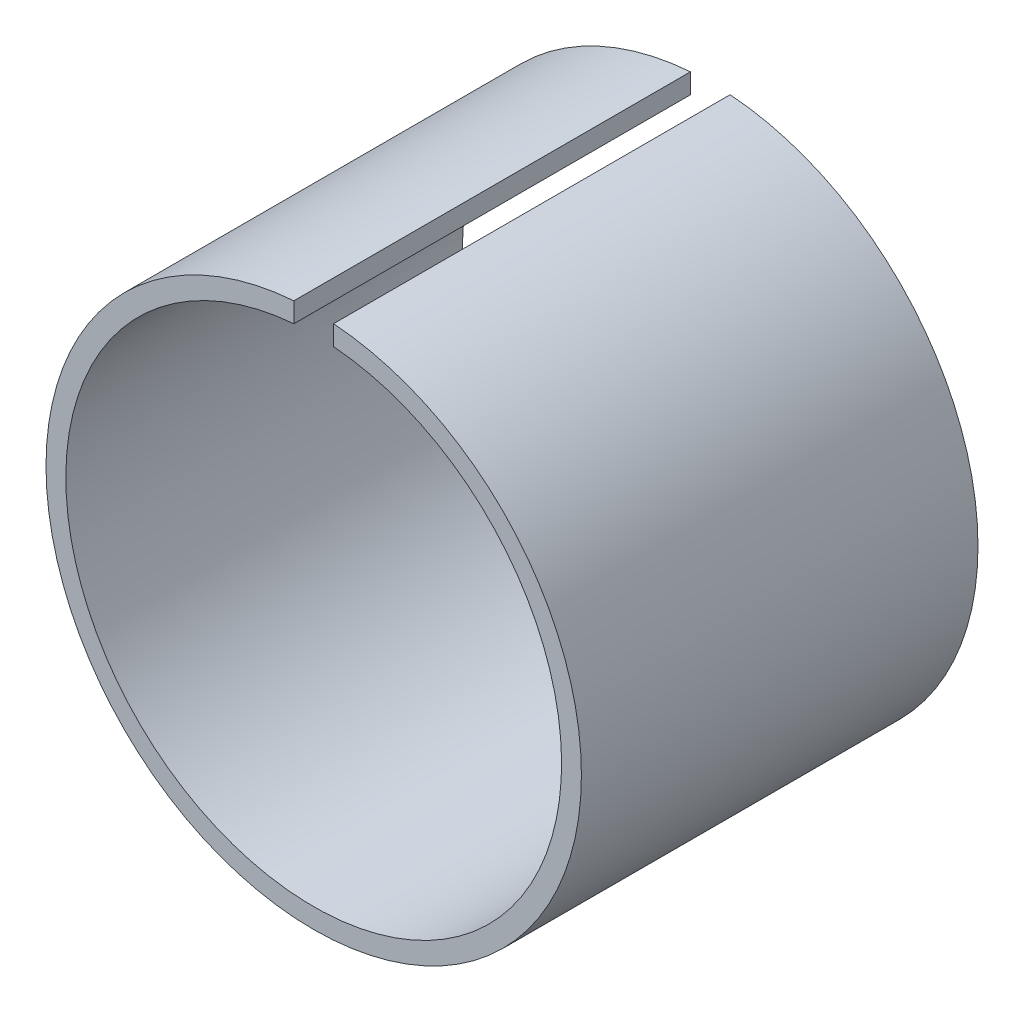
ISO-10303-21;
HEADER;
FILE_DESCRIPTION(('STEP AP214'),'2;1');
FILE_NAME('part.step','',(''),(''),'','','');
FILE_SCHEMA(('AUTOMOTIVE_DESIGN { 1 0 10303 214 1 1 1 1 }'));
ENDSEC;
DATA;
#1=APPLICATION_CONTEXT('core data for automotive mechanical design processes');
#2=APPLICATION_PROTOCOL_DEFINITION('international standard','automotive_design',2000,#1);
#3=PRODUCT_CONTEXT('',#1,'mechanical');
#4=PRODUCT('Part','Part','',(#3));
#5=PRODUCT_RELATED_PRODUCT_CATEGORY('part','',(#4));
#6=PRODUCT_DEFINITION_FORMATION('','',#4);
#7=PRODUCT_DEFINITION_CONTEXT('part definition',#1,'design');
#8=PRODUCT_DEFINITION('design','',#6,#7);
#9=PRODUCT_DEFINITION_SHAPE('','',#8);
#10=(LENGTH_UNIT() NAMED_UNIT(*) SI_UNIT(.MILLI.,.METRE.));
#11=(NAMED_UNIT(*) PLANE_ANGLE_UNIT() SI_UNIT($,.RADIAN.));
#12=(NAMED_UNIT(*) SI_UNIT($,.STERADIAN.) SOLID_ANGLE_UNIT());
#13=UNCERTAINTY_MEASURE_WITH_UNIT(LENGTH_MEASURE(1.E-05),#10,'distance_accuracy_value','');
#14=(GEOMETRIC_REPRESENTATION_CONTEXT(3) GLOBAL_UNCERTAINTY_ASSIGNED_CONTEXT((#13)) GLOBAL_UNIT_ASSIGNED_CONTEXT((#10,
#11,#12)) REPRESENTATION_CONTEXT('',''));
#15=CARTESIAN_POINT('',(0.,0.,0.));
#16=DIRECTION('',(0.,0.,1.));
#17=DIRECTION('',(1.,0.,0.));
#18=AXIS2_PLACEMENT_3D('',#15,#16,#17);
#19=CARTESIAN_POINT('',(0.,0.,20.));
#20=DIRECTION('',(0.,0.,-1.));
#21=DIRECTION('',(-1.,0.,0.));
#22=AXIS2_PLACEMENT_3D('',#19,#20,#21);
#23=CYLINDRICAL_SURFACE('',#22,13.5);
#24=CARTESIAN_POINT('',(0.,0.,0.));
#25=DIRECTION('',(0.,0.,1.));
#26=DIRECTION('',(1.,0.,0.));
#27=AXIS2_PLACEMENT_3D('',#24,#25,#26);
#28=CIRCLE('',#27,13.5);
#29=CARTESIAN_POINT('',(-1.,13.4629120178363,0.));
#30=VERTEX_POINT('',#29);
#31=CARTESIAN_POINT('',(1.,13.4629120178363,0.));
#32=VERTEX_POINT('',#31);
#33=EDGE_CURVE('E78',#30,#32,#28,.T.);
#34=ORIENTED_EDGE('',*,*,#33,.T.);
#35=DIRECTION('',(0.,0.,-1.));
#36=VECTOR('',#35,1.);
#37=CARTESIAN_POINT('',(1.,13.4629120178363,20.));
#38=LINE('',#37,#36);
#39=CARTESIAN_POINT('',(1.,13.4629120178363,20.));
#40=VERTEX_POINT('',#39);
#41=EDGE_CURVE('E11',#40,#32,#38,.T.);
#42=ORIENTED_EDGE('',*,*,#41,.F.);
#43=CARTESIAN_POINT('',(0.,0.,20.));
#44=DIRECTION('',(0.,0.,1.));
#45=DIRECTION('',(1.,0.,0.));
#46=AXIS2_PLACEMENT_3D('',#43,#44,#45);
#47=CIRCLE('',#46,13.5);
#48=CARTESIAN_POINT('',(-1.,13.4629120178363,20.));
#49=VERTEX_POINT('',#48);
#50=EDGE_CURVE('E96',#49,#40,#47,.T.);
#51=ORIENTED_EDGE('',*,*,#50,.F.);
#52=DIRECTION('',(0.,0.,-1.));
#53=VECTOR('',#52,1.);
#54=CARTESIAN_POINT('',(-1.,13.4629120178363,20.));
#55=LINE('',#54,#53);
#56=EDGE_CURVE('E90',#49,#30,#55,.T.);
#57=ORIENTED_EDGE('',*,*,#56,.T.);
#58=EDGE_LOOP('',(#34,#42,#51,#57));
#59=FACE_BOUND('',#58,.T.);
#60=ADVANCED_FACE('F34',(#59),#23,.T.);
#61=CARTESIAN_POINT('',(1.,13.4629120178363,20.));
#62=DIRECTION('',(1.,0.,0.));
#63=DIRECTION('',(0.,1.,0.));
#64=AXIS2_PLACEMENT_3D('',#61,#62,#63);
#65=PLANE('',#64);
#66=DIRECTION('',(0.,-1.,0.));
#67=VECTOR('',#66,1.);
#68=CARTESIAN_POINT('',(1.,13.4629120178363,0.));
#69=LINE('',#68,#67);
#70=CARTESIAN_POINT('',(1.,12.4599357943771,0.));
#71=VERTEX_POINT('',#70);
#72=EDGE_CURVE('E74',#32,#71,#69,.T.);
#73=ORIENTED_EDGE('',*,*,#72,.T.);
#74=DIRECTION('',(0.,0.,-1.));
#75=VECTOR('',#74,1.);
#76=CARTESIAN_POINT('',(1.,12.4599357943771,20.));
#77=LINE('',#76,#75);
#78=CARTESIAN_POINT('',(1.,12.4599357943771,20.));
#79=VERTEX_POINT('',#78);
#80=EDGE_CURVE('E41',#79,#71,#77,.T.);
#81=ORIENTED_EDGE('',*,*,#80,.F.);
#82=DIRECTION('',(0.,-1.,0.));
#83=VECTOR('',#82,1.);
#84=CARTESIAN_POINT('',(1.,13.4629120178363,20.));
#85=LINE('',#84,#83);
#86=EDGE_CURVE('E86',#40,#79,#85,.T.);
#87=ORIENTED_EDGE('',*,*,#86,.F.);
#88=ORIENTED_EDGE('',*,*,#41,.T.);
#89=EDGE_LOOP('',(#73,#81,#87,#88));
#90=FACE_BOUND('',#89,.T.);
#91=ADVANCED_FACE('F85',(#90),#65,.F.);
#92=CARTESIAN_POINT('',(0.,0.,20.));
#93=DIRECTION('',(0.,0.,-1.));
#94=DIRECTION('',(-1.,0.,0.));
#95=AXIS2_PLACEMENT_3D('',#92,#93,#94);
#96=CYLINDRICAL_SURFACE('',#95,12.5);
#97=CARTESIAN_POINT('',(0.,0.,0.));
#98=DIRECTION('',(0.,0.,-1.));
#99=DIRECTION('',(1.,0.,0.));
#100=AXIS2_PLACEMENT_3D('',#97,#98,#99);
#101=CIRCLE('',#100,12.5);
#102=CARTESIAN_POINT('',(-1.,12.4599357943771,0.));
#103=VERTEX_POINT('',#102);
#104=EDGE_CURVE('E79',#71,#103,#101,.T.);
#105=ORIENTED_EDGE('',*,*,#104,.T.);
#106=DIRECTION('',(0.,0.,-1.));
#107=VECTOR('',#106,1.);
#108=CARTESIAN_POINT('',(-1.,12.4599357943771,20.));
#109=LINE('',#108,#107);
#110=CARTESIAN_POINT('',(-1.,12.4599357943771,20.));
#111=VERTEX_POINT('',#110);
#112=EDGE_CURVE('E102',#111,#103,#109,.T.);
#113=ORIENTED_EDGE('',*,*,#112,.F.);
#114=CARTESIAN_POINT('',(0.,0.,20.));
#115=DIRECTION('',(0.,0.,-1.));
#116=DIRECTION('',(1.,0.,0.));
#117=AXIS2_PLACEMENT_3D('',#114,#115,#116);
#118=CIRCLE('',#117,12.5);
#119=EDGE_CURVE('E53',#79,#111,#118,.T.);
#120=ORIENTED_EDGE('',*,*,#119,.F.);
#121=ORIENTED_EDGE('',*,*,#80,.T.);
#122=EDGE_LOOP('',(#105,#113,#120,#121));
#123=FACE_BOUND('',#122,.T.);
#124=ADVANCED_FACE('F109',(#123),#96,.F.);
#125=CARTESIAN_POINT('',(-1.,13.4629120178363,20.));
#126=DIRECTION('',(-1.,0.,0.));
#127=DIRECTION('',(0.,-1.,0.));
#128=AXIS2_PLACEMENT_3D('',#125,#126,#127);
#129=PLANE('',#128);
#130=DIRECTION('',(0.,1.,0.));
#131=VECTOR('',#130,1.);
#132=CARTESIAN_POINT('',(-1.,13.4629120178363,0.));
#133=LINE('',#132,#131);
#134=EDGE_CURVE('E94',#103,#30,#133,.T.);
#135=ORIENTED_EDGE('',*,*,#134,.T.);
#136=ORIENTED_EDGE('',*,*,#56,.F.);
#137=DIRECTION('',(0.,1.,0.));
#138=VECTOR('',#137,1.);
#139=CARTESIAN_POINT('',(-1.,13.4629120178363,20.));
#140=LINE('',#139,#138);
#141=EDGE_CURVE('E48',#111,#49,#140,.T.);
#142=ORIENTED_EDGE('',*,*,#141,.F.);
#143=ORIENTED_EDGE('',*,*,#112,.T.);
#144=EDGE_LOOP('',(#135,#136,#142,#143));
#145=FACE_BOUND('',#144,.T.);
#146=ADVANCED_FACE('F111',(#145),#129,.F.);
#147=CARTESIAN_POINT('',(0.,0.,20.));
#148=DIRECTION('',(0.,0.,1.));
#149=DIRECTION('',(1.,0.,0.));
#150=AXIS2_PLACEMENT_3D('',#147,#148,#149);
#151=PLANE('',#150);
#152=ORIENTED_EDGE('',*,*,#50,.T.);
#153=ORIENTED_EDGE('',*,*,#86,.T.);
#154=ORIENTED_EDGE('',*,*,#119,.T.);
#155=ORIENTED_EDGE('',*,*,#141,.T.);
#156=EDGE_LOOP('',(#152,#153,#154,#155));
#157=FACE_BOUND('',#156,.T.);
#158=ADVANCED_FACE('F112',(#157),#151,.T.);
#159=CARTESIAN_POINT('',(0.,0.,0.));
#160=DIRECTION('',(0.,0.,1.));
#161=DIRECTION('',(1.,0.,0.));
#162=AXIS2_PLACEMENT_3D('',#159,#160,#161);
#163=PLANE('',#162);
#164=ORIENTED_EDGE('',*,*,#33,.F.);
#165=ORIENTED_EDGE('',*,*,#134,.F.);
#166=ORIENTED_EDGE('',*,*,#104,.F.);
#167=ORIENTED_EDGE('',*,*,#72,.F.);
#168=EDGE_LOOP('',(#164,#165,#166,#167));
#169=FACE_BOUND('',#168,.T.);
#170=ADVANCED_FACE('F75',(#169),#163,.F.);
#171=CLOSED_SHELL('',(#60,#91,#124,#146,#158,#170));
#172=MANIFOLD_SOLID_BREP('B2',#171);
#173=ADVANCED_BREP_SHAPE_REPRESENTATION('',(#18,#172),#14);
#174=SHAPE_DEFINITION_REPRESENTATION(#9,#173);
ENDSEC;
END-ISO-10303-21;
